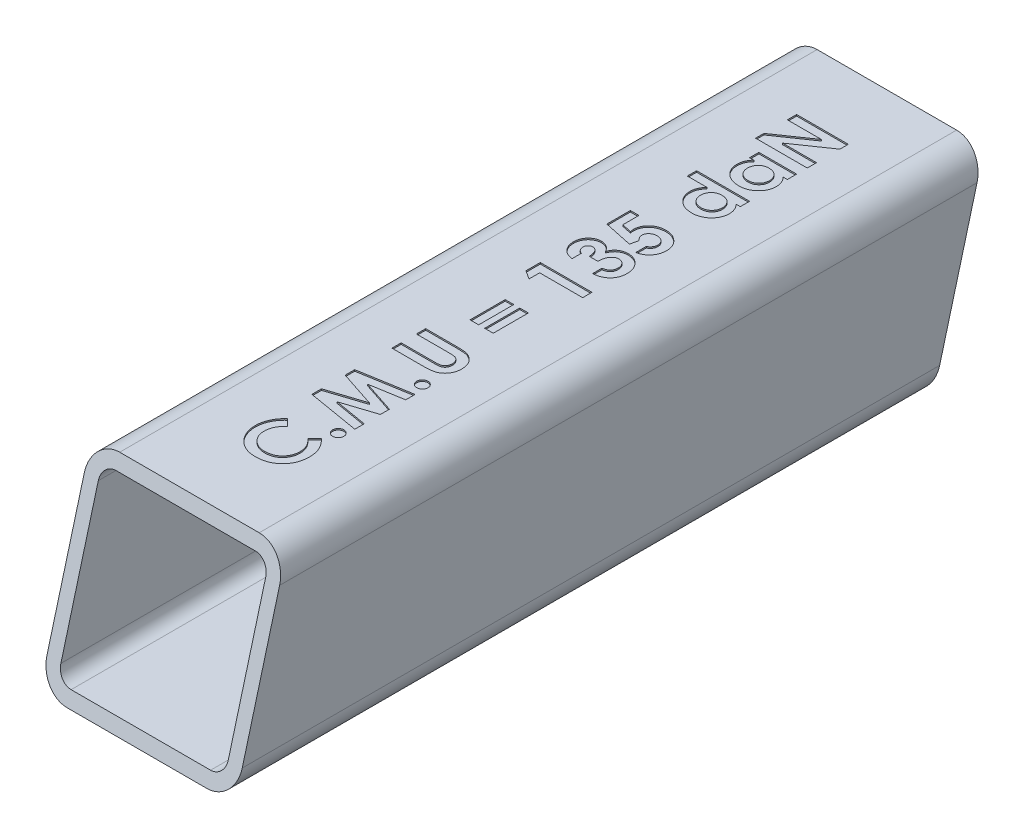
from build123d import *

# Parameters (mm, degrees)
BOSS_EXTRU_1_DEPTH      = 270
ENL_V_MAT_EXTRU_2_DEPTH = 125
ESQUISSE6_W             = 3.086805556
ESQUISSE6_H             = 12.584668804
ENL_V_MAT_EXTRU_4_DEPTH = 0.5


with BuildPart() as part:
    # Esquisse1 → Boss.-Extru.1 (new body)
    with BuildSketch(Plane.XY):
        with BuildLine():
            Line((-25, 35), (25, 35))
            ThreePointArc((25, 35), (32.071067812, 32.071067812), (35, 25))
            Line((35, 25), (35, -25))
            ThreePointArc((35, -25), (32.071067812, -32.071067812), (25, -35))
            Line((25, -35), (-25, -35))
            ThreePointArc((-25, -35), (-32.071067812, -32.071067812), (-35, -25))
            Line((-35, -25), (-35, 25))
            ThreePointArc((-35, 25), (-32.071067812, 32.071067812), (-25, 35))
        make_face()
        with BuildLine():
            Line((-25, 30), (25, 30))
            ThreePointArc((25, 30), (28.535533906, 28.535533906), (30, 25))
            Line((30, 25), (30, -25))
            ThreePointArc((30, -25), (28.535533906, -28.535533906), (25, -30))
            Line((25, -30), (-25, -30))
            ThreePointArc((-25, -30), (-28.535533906, -28.535533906), (-30, -25))
            Line((-30, -25), (-30, 25))
            ThreePointArc((-30, 25), (-28.535533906, 28.535533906), (-25, 30))
        make_face(mode=Mode.SUBTRACT)
    extrude(amount=BOSS_EXTRU_1_DEPTH)

    # Esquisse2 → Enl_v. mat.-Extru.2 (cut, symmetric)
    with BuildSketch(Plane(origin=(0, 0, 0), x_dir=(0, 0, -1), z_dir=(1, 0, 0))):
        Polygon((0, 35), (0, -35), (-18.75644347, -35), align=None)
        Polygon((-268.75644347, -35), (-250, 35), (-270, 35), (-270, -35), align=None)
    extrude(amount=ENL_V_MAT_EXTRU_2_DEPTH, both=True, mode=Mode.SUBTRACT)

    # Esquisse6 → Enl_v. mat.-Extru.4 (cut)
    # profile 1 of 13: a face of its own
    with BuildSketch(Plane(origin=(0, 35, 0), x_dir=(1, 0, 0), z_dir=(0, 1, 0))):
        with BuildLine():
            Line((-5.307884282, -209.507191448), (-2.977939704, -211.944729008))
            add(Edge.make_bspline(
                [(-2.977939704, -211.944729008), (-3.191779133, -212.151481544), (-3.609474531, -212.555334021), (-4.161854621, -213.206421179), (-4.624123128, -213.881798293), (-5.005632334, -214.574726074), (-5.305912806, -215.28656068), (-5.518244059, -216.019689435), (-5.64913729, -216.773041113), (-5.663999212, -217.283045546), (-5.671474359, -217.539564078)],
                knots=[0, 0, 0, 0, 1.115315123, 2.178559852, 3.196385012, 4.180486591, 5.141138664, 6.08807191, 7.038351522, 8, 8, 8, 8], degree=3))
            add(Edge.make_bspline(
                [(-5.671474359, -217.539564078), (-5.665551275, -217.753780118), (-5.65386272, -218.176511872), (-5.567967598, -218.797134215), (-5.42245016, -219.391016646), (-5.22018198, -219.958630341), (-4.965458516, -220.502781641), (-4.645289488, -221.018403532), (-4.270360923, -221.50826702), (-3.841328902, -221.966648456), (-3.369111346, -222.380467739), (-2.87178161, -222.753324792), (-2.340543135, -223.062159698), (-1.783143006, -223.314261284), (-1.199379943, -223.512923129), (-0.589283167, -223.653921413), (0.048524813, -223.735615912), (0.482117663, -223.747796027), (0.702482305, -223.75398632)],
                knots=[0, 0, 0, 0, 1.035268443, 2.04298821, 3.02163646, 3.985902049, 4.951223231, 5.920091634, 6.913651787, 7.92868536, 8.949353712, 9.945284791, 10.92850487, 11.913014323, 12.897904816, 13.904240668, 14.934873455, 16, 16, 16, 16], degree=3))
            add(Edge.make_bspline(
                [(0.702482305, -223.75398632), (0.857144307, -223.752174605), (1.16198629, -223.748603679), (1.611787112, -223.710580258), (2.049091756, -223.647258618), (2.472849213, -223.559051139), (2.883612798, -223.445976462), (3.282344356, -223.315355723), (3.664289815, -223.148519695), (4.036600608, -222.965002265), (4.390314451, -222.753871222), (4.725664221, -222.522682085), (5.042724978, -222.273565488), (5.340369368, -222.003194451), (5.614312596, -221.708164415), (5.872013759, -221.395600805), (6.109407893, -221.062398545), (6.322714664, -220.708424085), (6.521539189, -220.344389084), (6.686185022, -219.962793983), (6.83419367, -219.57431271), (6.945540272, -219.172127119), (7.042388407, -218.76332246), (7.10153655, -218.34220834), (7.146481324, -217.912781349), (7.14924849, -217.622548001), (7.150641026, -217.476492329)],
                knots=[0, 0, 0, 0, 1.103738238, 2.175490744, 3.219137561, 4.256155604, 5.262629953, 6.259184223, 7.247888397, 8.234817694, 9.220364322, 10.185094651, 11.140491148, 12.096499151, 13.05201798, 14.011605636, 14.986460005, 15.968997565, 16.960259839, 17.944382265, 18.933125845, 19.924977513, 20.920749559, 21.929466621, 22.958034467, 24, 24, 24, 24], degree=3))
            add(Edge.make_bspline(
                [(7.150641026, -217.476492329), (7.143502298, -217.228748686), (7.129476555, -216.741996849), (7.018996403, -216.027788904), (6.83919725, -215.346122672), (6.62073956, -214.803442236), (6.408913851, -214.37802307), (6.218492, -214.051441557), (5.998965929, -213.717313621), (5.749424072, -213.376148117), (5.470956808, -213.025964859), (5.158122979, -212.672558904), (4.821034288, -212.306996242), (4.580455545, -212.067515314), (4.45710637, -211.944729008)],
                knots=[0, 0, 0, 0, 1.404693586, 2.759857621, 4.088769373, 5.395275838, 6.0697462, 6.783214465, 7.53810233, 8.336454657, 9.18000028, 10.074808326, 11.012918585, 12, 12, 12, 12], degree=3))
            Line((4.45710637, -211.944729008), (6.939165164, -209.581393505))
            add(Edge.make_bspline(
                [(6.939165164, -209.581393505), (7.099558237, -209.74752327), (7.412611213, -210.071773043), (7.857117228, -210.560894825), (8.256555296, -211.049401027), (8.625423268, -211.525490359), (8.952975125, -211.996961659), (9.239537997, -212.463764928), (9.492359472, -212.92061575), (9.707175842, -213.377000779), (9.88957725, -213.835759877), (10.046612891, -214.307769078), (10.179459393, -214.794471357), (10.286649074, -215.298839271), (10.372600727, -215.816168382), (10.430617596, -216.351300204), (10.469620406, -216.900841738), (10.473125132, -217.273604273), (10.474893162, -217.461651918)],
                knots=[0, 0, 0, 0, 1.244526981, 2.429050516, 3.560637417, 4.644440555, 5.67424972, 6.652764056, 7.595344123, 8.486817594, 9.369275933, 10.254498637, 11.166417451, 12.086725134, 13.032340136, 13.991389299, 14.986715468, 16, 16, 16, 16], degree=3))
            add(Edge.make_bspline(
                [(10.474893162, -217.461651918), (10.466087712, -217.807072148), (10.448857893, -218.482963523), (10.321196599, -219.47346471), (10.107174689, -220.414414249), (9.804488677, -221.308101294), (9.417821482, -222.154241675), (8.943785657, -222.952618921), (8.383640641, -223.701946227), (7.743951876, -224.396170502), (7.037469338, -225.024129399), (6.278900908, -225.579172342), (5.464518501, -226.038303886), (4.606353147, -226.4195307), (3.700488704, -226.717645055), (2.745945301, -226.927467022), (1.743644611, -227.056862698), (1.059050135, -227.071018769), (0.709902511, -227.078238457)],
                knots=[0, 0, 0, 0, 1.078019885, 2.10938526, 3.111377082, 4.085535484, 5.04941344, 6.010039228, 6.978205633, 7.964457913, 8.951525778, 9.924444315, 10.892603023, 11.863865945, 12.85144698, 13.863884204, 14.910567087, 16, 16, 16, 16], degree=3))
            add(Edge.make_bspline(
                [(0.709902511, -227.078238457), (0.482185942, -227.075217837), (0.03090736, -227.069231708), (-0.634986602, -227.005137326), (-1.283300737, -226.918080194), (-1.908494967, -226.775071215), (-2.517685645, -226.608816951), (-3.105481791, -226.394622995), (-3.67435942, -226.145772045), (-4.223600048, -225.861630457), (-4.747272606, -225.536189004), (-5.248716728, -225.181869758), (-5.721436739, -224.790079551), (-6.167381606, -224.364783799), (-6.591602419, -223.909912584), (-6.983666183, -223.417675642), (-7.354091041, -222.896467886), (-7.691829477, -222.342678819), (-7.998996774, -221.768927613), (-8.263260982, -221.178002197), (-8.490009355, -220.577520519), (-8.676692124, -219.965661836), (-8.816418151, -219.341344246), (-8.922083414, -218.708751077), (-8.981173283, -218.062572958), (-8.99084452, -217.628717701), (-8.995726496, -217.409710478)],
                knots=[0, 0, 0, 0, 1.071814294, 2.12407397, 3.147667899, 4.14936388, 5.141177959, 6.119239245, 7.091825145, 8.063277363, 9.028022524, 9.992609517, 10.952139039, 11.915934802, 12.892469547, 13.878248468, 14.87668965, 15.901326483, 16.93027266, 17.938917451, 18.9468897, 19.950817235, 20.948103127, 21.957084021, 22.968749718, 24, 24, 24, 24], degree=3))
            add(Edge.make_bspline(
                [(-8.995726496, -217.409710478), (-8.992925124, -217.222875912), (-8.987351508, -216.851149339), (-8.940971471, -216.297570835), (-8.867925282, -215.748480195), (-8.758484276, -215.205554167), (-8.625946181, -214.66635124), (-8.462695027, -214.133128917), (-8.263566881, -213.607357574), (-8.043289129, -213.084479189), (-7.792514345, -212.574921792), (-7.511821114, -212.083113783), (-7.208552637, -211.607836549), (-6.877492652, -211.151955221), (-6.523503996, -210.712258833), (-6.14659839, -210.289216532), (-5.739938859, -209.886887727), (-5.452630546, -209.634396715), (-5.307884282, -209.507191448)],
                knots=[0, 0, 0, 0, 0.996333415, 1.982307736, 2.96084097, 3.949129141, 4.93457382, 5.921430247, 6.92116383, 7.931890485, 8.946633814, 9.948019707, 10.950686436, 11.952094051, 12.951305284, 13.960287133, 14.972390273, 16, 16, 16, 16], degree=3))
        make_face()
    # profile 2 of 13: a face of its own
    with BuildSketch(Plane(origin=(0, 35, 0), x_dir=(1, 0, 0), z_dir=(0, 1, 0))):
        with BuildLine():
            add(Edge.make_bspline(
                [(6.200854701, -204.876983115), (6.207725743, -204.742621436), (6.221271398, -204.477739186), (6.336417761, -204.098624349), (6.52393841, -203.751127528), (6.778777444, -203.444446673), (7.083071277, -203.183716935), (7.430790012, -202.995509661), (7.811030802, -202.878251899), (8.076075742, -202.865310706), (8.211730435, -202.858687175)],
                knots=[0, 0, 0, 0, 1.01719242, 2.005305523, 2.97459142, 3.994072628, 5.012345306, 5.994342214, 6.97346883, 8, 8, 8, 8], degree=3))
            add(Edge.make_bspline(
                [(8.211730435, -202.858687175), (8.347332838, -202.865474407), (8.613462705, -202.878794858), (8.995527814, -202.994509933), (9.344480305, -203.184803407), (9.652097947, -203.444104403), (9.910107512, -203.751070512), (10.10257272, -204.097613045), (10.216805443, -204.477853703), (10.230500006, -204.742659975), (10.237446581, -204.876983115)],
                knots=[0, 0, 0, 0, 1.023125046, 2.0079595, 2.986698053, 4.008755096, 5.030812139, 6.001348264, 6.986182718, 8, 8, 8, 8], degree=3))
            add(Edge.make_bspline(
                [(10.237446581, -204.876983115), (10.230556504, -205.011338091), (10.216973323, -205.276207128), (10.101609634, -205.657038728), (9.911392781, -206.006140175), (9.651782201, -206.313181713), (9.345582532, -206.573648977), (8.994403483, -206.758607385), (8.613609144, -206.875439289), (8.347382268, -206.888582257), (8.211730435, -206.895279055)],
                knots=[0, 0, 0, 0, 1.013339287, 1.99770941, 2.975986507, 3.997561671, 5.019136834, 5.992987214, 6.977357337, 8, 8, 8, 8], degree=3))
            add(Edge.make_bspline(
                [(8.211730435, -206.895279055), (8.076026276, -206.88874605), (7.810884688, -206.875981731), (7.431908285, -206.757619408), (7.081975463, -206.574724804), (6.779089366, -206.312844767), (6.522663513, -206.006063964), (6.337379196, -205.656040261), (6.221104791, -205.276319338), (6.207669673, -205.011375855), (6.200854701, -204.876983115)],
                knots=[0, 0, 0, 0, 1.026040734, 2.004699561, 2.981785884, 3.999572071, 5.018566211, 5.995652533, 6.983293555, 8, 8, 8, 8], degree=3))
        make_face()
    # profile 3 of 13: a face of its own
    with BuildSketch(Plane(origin=(0, 35, 0), x_dir=(1, 0, 0), z_dir=(0, 1, 0))):
        Polygon((-8.520833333, -197.594051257), (-8.520833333, -194.143655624), (4.397744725, -189.917848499), (-8.520833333, -185.662360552), (-8.520833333, -182.245355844), (10, -179.114029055), (10, -182.479092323), (-1.697954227, -184.456577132), (10, -188.307663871), (10, -191.550293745), (-1.697954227, -195.379119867), (10, -197.352894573), (10, -200.721667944), align=None)
    # profile 4 of 13: a face of its own
    with BuildSketch(Plane(origin=(0, 35, 0), x_dir=(1, 0, 0), z_dir=(0, 1, 0))):
        with BuildLine():
            add(Edge.make_bspline(
                [(6.200854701, -174.721267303), (6.207725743, -174.586905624), (6.221271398, -174.322023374), (6.336417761, -173.942908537), (6.52393841, -173.595411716), (6.778777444, -173.288730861), (7.083071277, -173.028001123), (7.430790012, -172.839793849), (7.811030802, -172.722536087), (8.076075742, -172.709594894), (8.211730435, -172.702971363)],
                knots=[0, 0, 0, 0, 1.01719242, 2.005305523, 2.97459142, 3.994072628, 5.012345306, 5.994342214, 6.97346883, 8, 8, 8, 8], degree=3))
            add(Edge.make_bspline(
                [(8.211730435, -172.702971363), (8.347332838, -172.709758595), (8.613462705, -172.723079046), (8.995527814, -172.838794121), (9.344480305, -173.029087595), (9.652097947, -173.288388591), (9.910107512, -173.5953547), (10.10257272, -173.941897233), (10.216805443, -174.322137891), (10.230500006, -174.586944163), (10.237446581, -174.721267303)],
                knots=[0, 0, 0, 0, 1.023125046, 2.0079595, 2.986698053, 4.008755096, 5.030812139, 6.001348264, 6.986182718, 8, 8, 8, 8], degree=3))
            add(Edge.make_bspline(
                [(10.237446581, -174.721267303), (10.230556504, -174.855622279), (10.216973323, -175.120491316), (10.101609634, -175.501322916), (9.911392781, -175.850424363), (9.651782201, -176.157465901), (9.345582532, -176.417933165), (8.994403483, -176.602891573), (8.613609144, -176.719723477), (8.347382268, -176.732866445), (8.211730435, -176.739563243)],
                knots=[0, 0, 0, 0, 1.013339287, 1.99770941, 2.975986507, 3.997561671, 5.019136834, 5.992987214, 6.977357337, 8, 8, 8, 8], degree=3))
            add(Edge.make_bspline(
                [(8.211730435, -176.739563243), (8.076026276, -176.733030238), (7.810884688, -176.720265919), (7.431908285, -176.601903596), (7.081975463, -176.419008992), (6.779089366, -176.157128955), (6.522663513, -175.850348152), (6.337379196, -175.500324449), (6.221104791, -175.120603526), (6.207669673, -174.855660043), (6.200854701, -174.721267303)],
                knots=[0, 0, 0, 0, 1.026040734, 2.004699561, 2.981785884, 3.999572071, 5.018566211, 5.995652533, 6.983293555, 8, 8, 8, 8], degree=3))
        make_face()
    # profile 5 of 13: a face of its own
    with BuildSketch(Plane(origin=(0, 35, 0), x_dir=(1, 0, 0), z_dir=(0, 1, 0))):
        with BuildLine():
            Line((-8.520833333, -168.903826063), (-8.520833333, -165.579573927))
            Line((-8.520833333, -165.579573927), (3.529580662, -165.579573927))
            add(Edge.make_bspline(
                [(3.529580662, -165.579573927), (3.654513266, -165.57938582), (3.895819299, -165.579022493), (4.242028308, -165.561642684), (4.561446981, -165.545262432), (4.851486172, -165.517391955), (5.113046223, -165.473675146), (5.347090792, -165.432859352), (5.551534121, -165.376900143), (5.7844034, -165.293100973), (6.04600707, -165.162271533), (6.321748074, -164.954764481), (6.567180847, -164.706965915), (6.773257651, -164.415145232), (6.947559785, -164.089337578), (7.062846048, -163.723122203), (7.141042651, -163.328404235), (7.14738173, -163.053403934), (7.150641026, -162.912009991)],
                knots=[0, 0, 0, 0, 1.155195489, 2.231248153, 3.20507519, 4.113220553, 4.92363642, 5.657123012, 6.309133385, 6.880755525, 7.944644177, 8.999147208, 10.058600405, 11.156792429, 12.29246015, 13.460660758, 14.694375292, 16, 16, 16, 16], degree=3))
            add(Edge.make_bspline(
                [(7.150641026, -162.912009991), (7.146262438, -162.761959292), (7.137724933, -162.469385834), (7.053920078, -162.048565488), (6.920474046, -161.658673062), (6.730012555, -161.307963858), (6.501711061, -160.996787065), (6.241375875, -160.733381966), (5.948487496, -160.52550525), (5.678276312, -160.390013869), (5.429568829, -160.313954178), (5.207363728, -160.256898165), (4.946370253, -160.21546835), (4.648401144, -160.176681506), (4.311285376, -160.154691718), (3.936785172, -160.129648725), (3.524672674, -160.120668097), (3.23771697, -160.119113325), (3.088078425, -160.118302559)],
                knots=[0, 0, 0, 0, 1.26131785, 2.459356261, 3.594833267, 4.716926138, 5.803419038, 6.833631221, 7.818372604, 8.814377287, 9.360705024, 10.004324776, 10.743421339, 11.582437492, 12.532246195, 13.585177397, 14.740744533, 16, 16, 16, 16], degree=3))
            Line((3.088078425, -160.118302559), (-8.520833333, -160.118302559))
            Line((-8.520833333, -160.118302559), (-8.520833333, -156.794050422))
            Line((-8.520833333, -156.794050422), (2.527852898, -156.794050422))
            add(Edge.make_bspline(
                [(2.527852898, -156.794050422), (2.751698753, -156.794512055), (3.182132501, -156.79539973), (3.800696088, -156.809031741), (4.365654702, -156.838051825), (4.877173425, -156.862425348), (5.334563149, -156.909596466), (5.739777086, -156.958737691), (6.091379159, -157.021372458), (6.491635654, -157.11456904), (6.95251469, -157.275399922), (7.483204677, -157.534674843), (8.002752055, -157.863828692), (8.505591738, -158.252789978), (8.972263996, -158.692271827), (9.383107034, -159.170619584), (9.724956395, -159.685638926), (10.001357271, -160.234950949), (10.214184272, -160.82435224), (10.364615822, -161.455232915), (10.460339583, -162.131200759), (10.469944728, -162.597550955), (10.474893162, -162.837807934)],
                knots=[0, 0, 0, 0, 1.170930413, 2.251584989, 3.235934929, 4.130173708, 4.929654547, 5.640582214, 6.264911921, 6.796838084, 7.789064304, 8.810388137, 9.880124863, 11.000704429, 12.131026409, 13.227749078, 14.29171941, 15.356377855, 16.43689688, 17.561893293, 18.743922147, 20, 20, 20, 20], degree=3))
            add(Edge.make_bspline(
                [(10.474893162, -162.837807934), (10.472196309, -162.997457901), (10.466875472, -163.312444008), (10.420204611, -163.775726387), (10.350863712, -164.223426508), (10.251664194, -164.655781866), (10.116249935, -165.071301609), (9.956223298, -165.472675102), (9.773122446, -165.861356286), (9.550908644, -166.225198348), (9.317498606, -166.573139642), (9.062111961, -166.893507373), (8.796073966, -167.191227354), (8.513295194, -167.462841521), (8.215790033, -167.708603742), (7.903267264, -167.928323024), (7.575654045, -168.12158914), (7.227072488, -168.293290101), (6.839795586, -168.440234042), (6.400061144, -168.564175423), (5.902121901, -168.671920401), (5.342697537, -168.753483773), (4.724335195, -168.825371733), (4.044675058, -168.871952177), (3.305916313, -168.895995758), (2.793760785, -168.901150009), (2.527852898, -168.903826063)],
                knots=[0, 0, 0, 0, 1.001237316, 1.975420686, 2.917953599, 3.841913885, 4.754568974, 5.656377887, 6.55158913, 7.445656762, 8.327865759, 9.178398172, 10.013362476, 10.830881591, 11.635451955, 12.431789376, 13.224756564, 14.019278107, 14.866442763, 15.819105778, 16.882716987, 18.059987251, 19.363897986, 20.787153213, 22.331910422, 24, 24, 24, 24], degree=3))
            Line((2.527852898, -168.903826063), (-8.520833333, -168.903826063))
        make_face()
    # profile 6 of 13: a face of its own
    with BuildSketch(Plane(origin=(0, 35, 0), x_dir=(1, 0, 0), z_dir=(0, 1, 0))):
        with Locations((-1.753605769, -139.816619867)):
            Rectangle(ESQUISSE6_W, ESQUISSE6_H)
    # profile 7 of 13: a face of its own
    with BuildSketch(Plane(origin=(0, 35, 0), x_dir=(1, 0, 0), z_dir=(0, 1, 0))):
        with Locations((3.470219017, -139.816619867)):
            Rectangle(ESQUISSE6_W, ESQUISSE6_H)
    # profile 8 of 13: a face of its own
    with BuildSketch(Plane(origin=(0, 35, 0), x_dir=(1, 0, 0), z_dir=(0, 1, 0))):
        Polygon((-8.520833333, -120.854284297), (-8.520833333, -115.715791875), (10, -115.715791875), (10, -119.040044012), (-5.434027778, -119.040044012), (-5.434027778, -122.839189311), align=None)
    # profile 9 of 13: a face of its own
    with BuildSketch(Plane(origin=(0, 35, 0), x_dir=(1, 0, 0), z_dir=(0, 1, 0))):
        with BuildLine():
            Line((-4.009348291, -105.505588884), (-4.009348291, -108.829841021))
            add(Edge.make_bspline(
                [(-4.009348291, -108.829841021), (-4.175552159, -108.806516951), (-4.500189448, -108.76095927), (-4.971307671, -108.648965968), (-5.41930635, -108.519452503), (-5.841781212, -108.3538231), (-6.238276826, -108.162633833), (-6.609148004, -107.939681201), (-6.959717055, -107.695310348), (-7.16980224, -107.503983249), (-7.274238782, -107.408871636)],
                knots=[0, 0, 0, 0, 1.1115466, 2.171125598, 3.205689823, 4.19946166, 5.17440286, 6.118867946, 7.064860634, 8, 8, 8, 8], degree=3))
            add(Edge.make_bspline(
                [(-7.274238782, -107.408871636), (-7.412248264, -107.272024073), (-7.684250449, -107.002311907), (-8.032655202, -106.551591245), (-8.334175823, -106.079152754), (-8.573223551, -105.575521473), (-8.766704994, -105.048534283), (-8.896666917, -104.4940004), (-8.9828978, -103.914185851), (-8.991391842, -103.518535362), (-8.995726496, -103.316628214)],
                knots=[0, 0, 0, 0, 1.01925491, 2.00884431, 2.983262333, 3.955970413, 4.92937149, 5.924503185, 6.940838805, 8, 8, 8, 8], degree=3))
            add(Edge.make_bspline(
                [(-8.995726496, -103.316628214), (-8.991488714, -103.137122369), (-8.983158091, -102.784250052), (-8.916284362, -102.265616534), (-8.798995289, -101.771142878), (-8.645642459, -101.295602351), (-8.436980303, -100.845988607), (-8.194767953, -100.412378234), (-7.897684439, -100.00688632), (-7.562009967, -99.628564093), (-7.198945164, -99.281002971), (-6.810858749, -98.980013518), (-6.408117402, -98.721247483), (-5.987375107, -98.508058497), (-5.547919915, -98.344145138), (-5.0922905, -98.230384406), (-4.621492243, -98.155925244), (-4.301497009, -98.148507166), (-4.13920189, -98.144744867)],
                knots=[0, 0, 0, 0, 1.091422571, 2.145516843, 3.172569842, 4.178562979, 5.178154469, 6.181868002, 7.194278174, 8.227918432, 9.254613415, 10.245994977, 11.209837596, 12.161663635, 13.10878368, 14.055455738, 15.013766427, 16, 16, 16, 16], degree=3))
            add(Edge.make_bspline(
                [(-4.13920189, -98.144744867), (-3.93824858, -98.152613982), (-3.541421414, -98.168153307), (-2.961778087, -98.291046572), (-2.408794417, -98.488604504), (-1.889022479, -98.769502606), (-1.403003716, -99.12224925), (-0.967712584, -99.554826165), (-0.576407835, -100.05516184), (-0.366117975, -100.430760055), (-0.258434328, -100.623093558)],
                knots=[0, 0, 0, 0, 0.992776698, 1.96045919, 2.915875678, 3.886951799, 4.871409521, 5.874469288, 6.911574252, 8, 8, 8, 8], degree=3))
            add(Edge.make_bspline(
                [(-0.258434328, -100.623093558), (-0.215096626, -100.491073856), (-0.129939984, -100.231661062), (0.037878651, -99.863011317), (0.220886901, -99.512179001), (0.434529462, -99.187187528), (0.663998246, -98.879124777), (0.92163111, -98.597737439), (1.200815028, -98.335739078), (1.504519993, -98.099611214), (1.827696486, -97.888501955), (2.16453589, -97.702453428), (2.516269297, -97.546323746), (2.880311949, -97.415284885), (3.260246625, -97.315305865), (3.654785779, -97.244966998), (4.062978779, -97.204296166), (4.339531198, -97.198094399), (4.479366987, -97.194958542)],
                knots=[0, 0, 0, 0, 1.059375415, 2.081625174, 3.086260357, 4.075579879, 5.045586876, 6.014170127, 6.982201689, 7.963705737, 8.945119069, 9.924852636, 10.896327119, 11.878239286, 12.873838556, 13.889973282, 14.933087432, 16, 16, 16, 16], degree=3))
            add(Edge.make_bspline(
                [(4.479366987, -97.194958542), (4.684868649, -97.201315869), (5.090076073, -97.213851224), (5.686904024, -97.293547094), (6.255930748, -97.441920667), (6.803683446, -97.637133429), (7.323166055, -97.897454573), (7.826013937, -98.204071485), (8.295174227, -98.579380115), (8.739650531, -99.000253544), (9.145719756, -99.465217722), (9.504486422, -99.965549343), (9.800232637, -100.502217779), (10.053018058, -101.062248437), (10.240624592, -101.658257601), (10.378011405, -102.282535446), (10.461601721, -102.939640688), (10.47039988, -103.388110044), (10.474893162, -103.617146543)],
                knots=[0, 0, 0, 0, 1.005228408, 1.982105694, 2.937129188, 3.876607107, 4.82066901, 5.774063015, 6.75178259, 7.752926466, 8.764612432, 9.766578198, 10.757677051, 11.756882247, 12.76686714, 13.807379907, 14.880213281, 16, 16, 16, 16], degree=3))
            add(Edge.make_bspline(
                [(10.474893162, -103.617146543), (10.470166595, -103.833815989), (10.460924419, -104.257484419), (10.3809287, -104.877188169), (10.251889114, -105.466157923), (10.069997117, -106.025896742), (9.834114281, -106.554239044), (9.553230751, -107.055976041), (9.211145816, -107.52109568), (8.823301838, -107.954780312), (8.388162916, -108.347409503), (7.915808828, -108.698327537), (7.404443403, -108.99979661), (6.85625141, -109.253053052), (6.270271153, -109.45611697), (5.647694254, -109.616293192), (4.98730439, -109.728178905), (4.532942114, -109.762253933), (4.301282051, -109.779627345)],
                knots=[0, 0, 0, 0, 1.066544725, 2.085487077, 3.070979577, 4.031932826, 4.977951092, 5.916076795, 6.857635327, 7.814973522, 8.776389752, 9.738577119, 10.707772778, 11.69409279, 12.707140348, 13.757286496, 14.856535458, 16, 16, 16, 16], degree=3))
            Line((4.301282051, -109.779627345), (4.301282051, -106.455375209))
            add(Edge.make_bspline(
                [(4.301282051, -106.455375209), (4.417761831, -106.434305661), (4.644636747, -106.393267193), (4.973133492, -106.313296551), (5.276236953, -106.208809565), (5.55617396, -106.089349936), (5.815817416, -105.957273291), (6.048223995, -105.7994646), (6.262527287, -105.63025867), (6.508854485, -105.375903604), (6.767180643, -105.021020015), (6.995966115, -104.540528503), (7.126085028, -104.003588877), (7.142273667, -103.628976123), (7.150641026, -103.435351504)],
                knots=[0, 0, 0, 0, 0.928450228, 1.808400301, 2.64896863, 3.43999153, 4.194978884, 4.9294959, 5.640047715, 6.332896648, 7.70085756, 9.063442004, 10.482192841, 12, 12, 12, 12], degree=3))
            add(Edge.make_bspline(
                [(7.150641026, -103.435351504), (7.14886907, -103.332593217), (7.145398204, -103.131312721), (7.107277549, -102.835586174), (7.043763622, -102.554153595), (6.959789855, -102.284677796), (6.845837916, -102.031393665), (6.71359707, -101.788566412), (6.551714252, -101.560636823), (6.367264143, -101.348932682), (6.17030539, -101.151906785), (5.954780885, -100.983669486), (5.731039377, -100.83842182), (5.493162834, -100.723811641), (5.248660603, -100.627890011), (4.989761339, -100.568065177), (4.722084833, -100.52316565), (4.538930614, -100.520542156), (4.445976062, -100.519210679)],
                knots=[0, 0, 0, 0, 1.110702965, 2.175618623, 3.217100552, 4.227908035, 5.221854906, 6.215531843, 7.213608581, 8.237687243, 9.249555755, 10.220750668, 11.188994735, 12.127982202, 13.071814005, 14.022160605, 14.996205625, 16, 16, 16, 16], degree=3))
            add(Edge.make_bspline(
                [(4.445976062, -100.519210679), (4.344281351, -100.522596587), (4.143046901, -100.529296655), (3.84814745, -100.58825693), (3.563379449, -100.676511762), (3.291092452, -100.803438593), (3.032887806, -100.969528), (2.786627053, -101.171475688), (2.55427083, -101.411108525), (2.329051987, -101.680401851), (2.131896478, -101.990221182), (1.950345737, -102.328055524), (1.8057866, -102.702227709), (1.676700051, -103.103761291), (1.582409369, -103.540206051), (1.513947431, -104.008864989), (1.46298745, -104.508978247), (1.455676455, -104.853712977), (1.451923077, -105.030695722)],
                knots=[0, 0, 0, 0, 0.809868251, 1.602574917, 2.388262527, 3.182133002, 3.988875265, 4.829537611, 5.714850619, 6.646378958, 7.622533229, 8.636771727, 9.698525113, 10.814716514, 11.996253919, 13.252421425, 14.589425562, 16, 16, 16, 16], degree=3))
            Line((1.451923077, -105.030695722), (-1.634882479, -105.030695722))
            add(Edge.make_bspline(
                [(-1.634882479, -105.030695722), (-1.653578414, -104.810314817), (-1.688554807, -104.398025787), (-1.771499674, -103.82614008), (-1.878798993, -103.343046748), (-2.018639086, -102.943223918), (-2.181982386, -102.605739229), (-2.371243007, -102.315053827), (-2.588573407, -102.061439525), (-2.833656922, -101.852831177), (-3.090554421, -101.678986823), (-3.363778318, -101.559981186), (-3.642457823, -101.480215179), (-3.833208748, -101.472713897), (-3.927726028, -101.468997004)],
                knots=[0, 0, 0, 0, 1.700711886, 3.181695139, 4.441392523, 5.500267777, 6.431839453, 7.31822765, 8.161090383, 8.990537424, 9.787217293, 10.536619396, 11.274893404, 12, 12, 12, 12], degree=3))
            add(Edge.make_bspline(
                [(-3.927726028, -101.468997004), (-4.048332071, -101.475383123), (-4.283729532, -101.487847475), (-4.621233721, -101.586550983), (-4.923684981, -101.754054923), (-5.187700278, -101.981331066), (-5.403061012, -102.260542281), (-5.563233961, -102.583678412), (-5.65667296, -102.94910207), (-5.666428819, -103.206017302), (-5.671474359, -103.338888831)],
                knots=[0, 0, 0, 0, 1.009324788, 1.969988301, 2.915956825, 3.885795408, 4.868116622, 5.850437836, 6.888288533, 8, 8, 8, 8], degree=3))
            add(Edge.make_bspline(
                [(-5.671474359, -103.338888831), (-5.665545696, -103.459336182), (-5.653781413, -103.698340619), (-5.56597592, -104.047836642), (-5.4181663, -104.379741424), (-5.214345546, -104.687182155), (-4.969565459, -104.965720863), (-4.679674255, -105.19432078), (-4.362039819, -105.384459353), (-4.127373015, -105.465054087), (-4.009348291, -105.505588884)],
                knots=[0, 0, 0, 0, 0.98818071, 1.960853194, 2.938124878, 3.957524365, 4.978590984, 5.968022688, 6.978025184, 8, 8, 8, 8], degree=3))
        make_face()
    # profile 10 of 13: a face of its own
    with BuildSketch(Plane(origin=(0, 35, 0), x_dir=(1, 0, 0), z_dir=(0, 1, 0))):
        with BuildLine():
            Line((-8.520833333, -91.856120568), (-8.520833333, -83.423056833))
            Line((-8.520833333, -83.423056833), (-5.434027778, -83.423056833))
            Line((-5.434027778, -83.423056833), (-5.434027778, -89.221947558))
            Line((-5.434027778, -89.221947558), (-1.931690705, -89.94541761))
            add(Edge.make_bspline(
                [(-1.931690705, -89.94541761), (-1.959147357, -89.846834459), (-2.013297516, -89.652408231), (-2.067603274, -89.359504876), (-2.102802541, -89.075640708), (-2.107497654, -88.889370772), (-2.109775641, -88.798995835)],
                knots=[0, 0, 0, 0, 1.05461699, 2.079921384, 3.068411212, 4, 4, 4, 4], degree=3))
            add(Edge.make_bspline(
                [(-2.109775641, -88.798995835), (-2.105262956, -88.602059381), (-2.096367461, -88.213854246), (-2.011920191, -87.645959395), (-1.878918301, -87.102166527), (-1.689230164, -86.584139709), (-1.442346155, -86.092384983), (-1.143685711, -85.626306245), (-0.792724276, -85.185331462), (-0.389242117, -84.777294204), (0.053790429, -84.402372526), (0.532977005, -84.07639951), (1.041484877, -83.797998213), (1.582474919, -83.576567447), (2.152549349, -83.401795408), (2.75207349, -83.27550123), (3.381757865, -83.200817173), (3.811346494, -83.190746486), (4.030444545, -83.185610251)],
                knots=[0, 0, 0, 0, 1.01440847, 1.999622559, 2.951875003, 3.895578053, 4.836219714, 5.782137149, 6.743708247, 7.735272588, 8.734977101, 9.730283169, 10.717124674, 11.717316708, 12.737475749, 13.78628267, 14.87096371, 16, 16, 16, 16], degree=3))
            add(Edge.make_bspline(
                [(4.030444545, -83.185610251), (4.252027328, -83.191891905), (4.689274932, -83.204287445), (5.332227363, -83.285018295), (5.947862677, -83.427905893), (6.537548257, -83.622480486), (7.096206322, -83.883974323), (7.634190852, -84.189591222), (8.139946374, -84.56149701), (8.614980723, -84.981710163), (9.049456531, -85.440394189), (9.430673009, -85.929986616), (9.75713558, -86.442270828), (10.016060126, -86.984494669), (10.221947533, -87.548365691), (10.371506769, -88.135841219), (10.457343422, -88.749455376), (10.468978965, -89.166031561), (10.474893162, -89.377771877)],
                knots=[0, 0, 0, 0, 1.068214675, 2.107899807, 3.117335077, 4.110871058, 5.095206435, 6.086091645, 7.088956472, 8.115291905, 9.140102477, 10.129911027, 11.102477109, 12.062389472, 13.02046727, 13.992137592, 14.979429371, 16, 16, 16, 16], degree=3))
            add(Edge.make_bspline(
                [(10.474893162, -89.377771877), (10.469895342, -89.5670873), (10.460038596, -89.940456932), (10.403618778, -90.491290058), (10.291569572, -91.019581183), (10.15089504, -91.530538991), (9.956983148, -92.017099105), (9.734146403, -92.489287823), (9.454379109, -92.932890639), (9.146174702, -93.360510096), (8.796149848, -93.755707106), (8.417914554, -94.12263603), (8.004398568, -94.447339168), (7.563639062, -94.741913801), (7.087406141, -94.990354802), (6.584266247, -95.212446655), (6.04855592, -95.393882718), (5.677222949, -95.48601281), (5.488514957, -95.532832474)],
                knots=[0, 0, 0, 0, 1.055144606, 2.080965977, 3.079696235, 4.061281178, 5.030010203, 5.994686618, 6.966205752, 7.947572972, 8.929036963, 9.903776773, 10.879904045, 11.854643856, 12.853445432, 13.868704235, 14.916895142, 16, 16, 16, 16], degree=3))
            Line((5.488514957, -95.532832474), (5.488514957, -91.733687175))
            add(Edge.make_bspline(
                [(5.488514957, -91.733687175), (5.619316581, -91.664260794), (5.873514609, -91.529338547), (6.21048231, -91.272300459), (6.499250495, -90.986521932), (6.734477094, -90.667340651), (6.920875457, -90.325353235), (7.056359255, -89.962286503), (7.135848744, -89.580333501), (7.145677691, -89.320011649), (7.150641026, -89.188556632)],
                knots=[0, 0, 0, 0, 1.10506944, 2.147576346, 3.153981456, 4.13180336, 5.099527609, 6.055753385, 7.01821161, 8, 8, 8, 8], degree=3))
            add(Edge.make_bspline(
                [(7.150641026, -89.188556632), (7.147194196, -89.096945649), (7.140412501, -88.916699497), (7.104535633, -88.651135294), (7.036585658, -88.397642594), (6.942490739, -88.154336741), (6.825143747, -87.920564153), (6.677000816, -87.699676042), (6.506482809, -87.487829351), (6.310812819, -87.288249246), (6.092686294, -87.107487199), (5.858294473, -86.948978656), (5.612845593, -86.807250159), (5.346616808, -86.702269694), (5.067557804, -86.616299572), (4.773563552, -86.552987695), (4.464290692, -86.515151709), (4.253158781, -86.511649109), (4.145457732, -86.509862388)],
                knots=[0, 0, 0, 0, 0.978869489, 1.925942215, 2.855067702, 3.774946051, 4.70828698, 5.642468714, 6.60995405, 7.609372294, 8.622401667, 9.629904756, 10.629323, 11.642352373, 12.678539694, 13.745912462, 14.850161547, 16, 16, 16, 16], degree=3))
            add(Edge.make_bspline(
                [(4.145457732, -86.509862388), (4.040256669, -86.511936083), (3.835480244, -86.515972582), (3.534795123, -86.549363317), (3.249499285, -86.609098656), (2.977407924, -86.690488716), (2.720172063, -86.794677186), (2.476265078, -86.92200435), (2.246902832, -87.073005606), (2.036818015, -87.248523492), (1.843943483, -87.435601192), (1.675890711, -87.636915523), (1.534493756, -87.848668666), (1.418967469, -88.070468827), (1.323249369, -88.300283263), (1.26376049, -88.543296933), (1.218353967, -88.793597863), (1.215782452, -88.964492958), (1.214476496, -89.051282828)],
                knots=[0, 0, 0, 0, 1.166353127, 2.270334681, 3.348811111, 4.394351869, 5.415506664, 6.421447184, 7.440758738, 8.453871, 9.452682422, 10.416618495, 11.356052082, 12.270018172, 13.186757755, 14.10810127, 15.039190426, 16, 16, 16, 16], degree=3))
            add(Edge.make_bspline(
                [(1.214476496, -89.051282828), (1.217955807, -89.14557373), (1.224929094, -89.334552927), (1.284650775, -89.614354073), (1.373045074, -89.893248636), (1.505032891, -90.167608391), (1.674380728, -90.440013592), (1.878982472, -90.710933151), (2.122108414, -90.979271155), (2.303934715, -91.14882022), (2.397999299, -91.236533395)],
                knots=[0, 0, 0, 0, 0.882519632, 1.768758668, 2.670168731, 3.618680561, 4.612333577, 5.671392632, 6.795336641, 8, 8, 8, 8], degree=3))
            Line((2.397999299, -91.236533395), (1.756151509, -94.03395093))
            Line((1.756151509, -94.03395093), (-8.520833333, -91.856120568))
        make_face()
    # profile 11 of 13: a face of its own
    with BuildSketch(Plane(origin=(0, 35, 0), x_dir=(1, 0, 0), z_dir=(0, 1, 0))):
        with BuildLine():
            Line((-8.995726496, -62.527757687), (-8.995726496, -59.203505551))
            Line((-8.995726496, -59.203505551), (10, -59.203505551))
            Line((10, -59.203505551), (10, -62.527757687))
            Line((10, -62.527757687), (8.523379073, -62.527757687))
            add(Edge.make_bspline(
                [(8.523379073, -62.527757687), (8.666701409, -62.692755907), (8.945336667, -63.013531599), (9.312891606, -63.513515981), (9.605718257, -64.022307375), (9.844665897, -64.529958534), (10.019884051, -65.050988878), (10.147109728, -65.58720954), (10.222052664, -66.146703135), (10.232261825, -66.527025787), (10.237446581, -66.720173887)],
                knots=[0, 0, 0, 0, 1.129123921, 2.195147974, 3.200207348, 4.157999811, 5.089597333, 6.035096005, 7.002117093, 8, 8, 8, 8], degree=3))
            add(Edge.make_bspline(
                [(10.237446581, -66.720173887), (10.232570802, -66.936993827), (10.222935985, -67.365442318), (10.12144487, -67.994119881), (9.966238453, -68.60126018), (9.746060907, -69.185943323), (9.462447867, -69.749308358), (9.114330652, -70.288191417), (8.708003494, -70.808241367), (8.23929126, -71.294708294), (7.729967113, -71.74602123), (7.180644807, -72.137197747), (6.602317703, -72.470644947), (5.992305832, -72.74067884), (5.352777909, -72.954288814), (4.681926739, -73.106346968), (3.979720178, -73.196113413), (3.501396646, -73.207219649), (3.258743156, -73.212853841)],
                knots=[0, 0, 0, 0, 0.980565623, 1.937653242, 2.874408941, 3.813202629, 4.759425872, 5.723639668, 6.712366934, 7.741707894, 8.776921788, 9.78808311, 10.788528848, 11.79333378, 12.802261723, 13.835597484, 14.901998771, 16, 16, 16, 16], degree=3))
            add(Edge.make_bspline(
                [(3.258743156, -73.212853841), (3.007473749, -73.206944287), (2.51458081, -73.195352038), (1.791319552, -73.110419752), (1.103763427, -72.961352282), (0.450499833, -72.756543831), (-0.168670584, -72.497640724), (-0.751255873, -72.175654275), (-1.299347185, -71.795114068), (-1.806892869, -71.360486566), (-2.265464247, -70.883487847), (-2.666892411, -70.377277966), (-3.014402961, -69.849114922), (-3.287168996, -69.288615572), (-3.504194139, -68.707227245), (-3.661353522, -68.100925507), (-3.756041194, -67.468913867), (-3.766570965, -67.038331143), (-3.771901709, -66.820346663)],
                knots=[0, 0, 0, 0, 1.136200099, 2.228783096, 3.287341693, 4.313263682, 5.320819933, 6.317074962, 7.317731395, 8.33320375, 9.333922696, 10.3051871, 11.251461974, 12.186899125, 13.117710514, 14.053682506, 15.014667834, 16, 16, 16, 16], degree=3))
            add(Edge.make_bspline(
                [(-3.771901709, -66.820346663), (-3.766035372, -66.618467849), (-3.754429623, -66.219078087), (-3.666957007, -65.631044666), (-3.524614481, -65.06224195), (-3.329317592, -64.511239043), (-3.069711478, -63.981911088), (-2.757040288, -63.472468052), (-2.38823921, -62.981359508), (-2.103001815, -62.68086978), (-1.957661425, -62.527757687)],
                knots=[0, 0, 0, 0, 1.011981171, 2.002067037, 2.973628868, 3.94845042, 4.927444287, 5.923956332, 6.942168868, 8, 8, 8, 8], degree=3))
            Line((-1.957661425, -62.527757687), (-8.995726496, -62.527757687))
        make_face()
        with BuildLine():
            add(Edge.make_bspline(
                [(-0.685096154, -66.122847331), (-0.681030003, -66.255307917), (-0.673060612, -66.514922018), (-0.625170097, -66.896738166), (-0.54064887, -67.261570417), (-0.416256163, -67.607141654), (-0.263364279, -67.936830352), (-0.07810577, -68.250706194), (0.147698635, -68.544263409), (0.401631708, -68.820431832), (0.681095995, -69.073905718), (0.988472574, -69.287038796), (1.308986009, -69.476275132), (1.651022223, -69.628919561), (2.014170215, -69.741921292), (2.394397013, -69.830097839), (2.795098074, -69.876074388), (3.068194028, -69.88438415), (3.206801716, -69.888601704)],
                knots=[0, 0, 0, 0, 1.048146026, 2.054297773, 3.039291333, 4.004895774, 4.954855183, 5.911393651, 6.882091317, 7.879305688, 8.877191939, 9.859995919, 10.833402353, 11.818978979, 12.815424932, 13.838562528, 14.902979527, 16, 16, 16, 16], degree=3))
            add(Edge.make_bspline(
                [(3.206801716, -69.888601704), (3.346665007, -69.884444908), (3.622263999, -69.876253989), (4.02636861, -69.829397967), (4.41206425, -69.74421191), (4.775932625, -69.619511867), (5.122992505, -69.469098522), (5.449604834, -69.280354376), (5.757210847, -69.058438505), (6.041745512, -68.802106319), (6.299665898, -68.522206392), (6.526938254, -68.224152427), (6.723158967, -67.911488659), (6.876667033, -67.579885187), (7.002876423, -67.235763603), (7.086154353, -66.872986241), (7.139474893, -66.495439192), (7.14689328, -66.23804278), (7.150641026, -66.108006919)],
                knots=[0, 0, 0, 0, 1.099325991, 2.166209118, 3.191924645, 4.196940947, 5.184751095, 6.160002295, 7.155385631, 8.160260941, 9.164478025, 10.142244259, 11.102414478, 12.058888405, 13.008821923, 13.977708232, 14.978344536, 16, 16, 16, 16], degree=3))
            add(Edge.make_bspline(
                [(7.150641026, -66.108006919), (7.146555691, -65.973076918), (7.138546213, -65.708540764), (7.09104207, -65.320526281), (7.006397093, -64.950680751), (6.880615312, -64.600876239), (6.73077326, -64.26396536), (6.539057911, -63.948189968), (6.315779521, -63.649484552), (6.058896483, -63.373402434), (5.780940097, -63.116255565), (5.472092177, -62.897588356), (5.146203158, -62.705646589), (4.795009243, -62.554945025), (4.425005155, -62.435197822), (4.033798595, -62.349299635), (3.620994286, -62.302571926), (3.339238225, -62.294449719), (3.195671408, -62.290311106)],
                knots=[0, 0, 0, 0, 1.050155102, 2.058874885, 3.037059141, 3.995876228, 4.947712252, 5.901735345, 6.864168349, 7.84500044, 8.832936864, 9.80518476, 10.78407896, 11.771077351, 12.772424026, 13.806938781, 14.882541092, 16, 16, 16, 16], degree=3))
            add(Edge.make_bspline(
                [(3.195671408, -62.290311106), (3.054572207, -62.294394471), (2.778964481, -62.302370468), (2.374802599, -62.349543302), (1.991193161, -62.435857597), (1.626877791, -62.554185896), (1.281981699, -62.705674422), (0.963122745, -62.898712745), (0.658362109, -63.11616599), (0.384713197, -63.373801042), (0.129469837, -63.648690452), (-0.083515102, -63.952715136), (-0.27179019, -64.268656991), (-0.425486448, -64.603956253), (-0.538445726, -64.959821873), (-0.625822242, -65.330258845), (-0.673038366, -65.720952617), (-0.681011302, -65.986696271), (-0.685096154, -66.122847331)],
                knots=[0, 0, 0, 0, 1.106392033, 2.161105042, 3.184375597, 4.183944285, 5.160535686, 6.12997743, 7.101598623, 8.089721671, 9.071306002, 10.0372504, 10.99341283, 11.95232427, 12.921232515, 13.916134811, 14.932352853, 16, 16, 16, 16], degree=3))
        make_face(mode=Mode.SUBTRACT)
    # profile 12 of 13: a face of its own
    with BuildSketch(Plane(origin=(0, 35, 0), x_dir=(1, 0, 0), z_dir=(0, 1, 0))):
        with BuildLine():
            Line((-3.534455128, -45.669050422), (-3.534455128, -42.344798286))
            Line((-3.534455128, -42.344798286), (10, -42.344798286))
            Line((10, -42.344798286), (10, -45.669050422))
            Line((10, -45.669050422), (8.523379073, -45.669050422))
            add(Edge.make_bspline(
                [(8.523379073, -45.669050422), (8.666701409, -45.834048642), (8.945336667, -46.154824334), (9.312891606, -46.654808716), (9.605718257, -47.16360011), (9.844665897, -47.671251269), (10.019884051, -48.192281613), (10.147109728, -48.728502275), (10.222052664, -49.28799587), (10.232261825, -49.668318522), (10.237446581, -49.861466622)],
                knots=[0, 0, 0, 0, 1.129123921, 2.195147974, 3.200207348, 4.157999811, 5.089597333, 6.035096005, 7.002117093, 8, 8, 8, 8], degree=3))
            add(Edge.make_bspline(
                [(10.237446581, -49.861466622), (10.232570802, -50.078286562), (10.222935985, -50.506735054), (10.12144487, -51.135412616), (9.966238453, -51.742552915), (9.746060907, -52.327236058), (9.462447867, -52.890601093), (9.114330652, -53.429484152), (8.708003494, -53.949534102), (8.23929126, -54.436001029), (7.729967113, -54.887313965), (7.180644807, -55.278490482), (6.602317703, -55.611937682), (5.992305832, -55.881971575), (5.352777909, -56.095581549), (4.681926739, -56.247639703), (3.979720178, -56.337406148), (3.501396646, -56.348512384), (3.258743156, -56.354146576)],
                knots=[0, 0, 0, 0, 0.980565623, 1.937653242, 2.874408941, 3.813202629, 4.759425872, 5.723639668, 6.712366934, 7.741707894, 8.776921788, 9.78808311, 10.788528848, 11.79333378, 12.802261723, 13.835597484, 14.901998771, 16, 16, 16, 16], degree=3))
            add(Edge.make_bspline(
                [(3.258743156, -56.354146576), (3.007473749, -56.348237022), (2.51458081, -56.336644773), (1.791319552, -56.251712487), (1.103763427, -56.102645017), (0.450499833, -55.897836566), (-0.168670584, -55.638933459), (-0.751255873, -55.31694701), (-1.299347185, -54.936406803), (-1.806892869, -54.501779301), (-2.265464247, -54.024780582), (-2.666892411, -53.518570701), (-3.014402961, -52.990407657), (-3.287168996, -52.429908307), (-3.504194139, -51.84851998), (-3.661353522, -51.242218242), (-3.756041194, -50.610206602), (-3.766570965, -50.179623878), (-3.771901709, -49.961639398)],
                knots=[0, 0, 0, 0, 1.136200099, 2.228783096, 3.287341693, 4.313263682, 5.320819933, 6.317074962, 7.317731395, 8.33320375, 9.333922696, 10.3051871, 11.251461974, 12.186899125, 13.117710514, 14.053682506, 15.014667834, 16, 16, 16, 16], degree=3))
            add(Edge.make_bspline(
                [(-3.771901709, -49.961639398), (-3.767812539, -49.759695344), (-3.759721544, -49.360120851), (-3.668107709, -48.773504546), (-3.53758729, -48.202952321), (-3.343044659, -47.653736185), (-3.092741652, -47.123199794), (-2.786517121, -46.615130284), (-2.429708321, -46.122722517), (-2.15136818, -45.822142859), (-2.009602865, -45.669050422)],
                knots=[0, 0, 0, 0, 1.016860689, 2.012000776, 2.985574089, 3.963288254, 4.94189597, 5.937036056, 6.949282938, 8, 8, 8, 8], degree=3))
            Line((-2.009602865, -45.669050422), (-3.534455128, -45.669050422))
        make_face()
        with BuildLine():
            add(Edge.make_bspline(
                [(-0.685096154, -49.264140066), (-0.681030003, -49.396600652), (-0.673060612, -49.656214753), (-0.625170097, -50.038030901), (-0.54064887, -50.402863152), (-0.416256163, -50.748434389), (-0.263364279, -51.078123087), (-0.07810577, -51.391998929), (0.147698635, -51.685556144), (0.401631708, -51.961724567), (0.681095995, -52.215198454), (0.988472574, -52.428331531), (1.308986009, -52.617567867), (1.651022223, -52.770212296), (2.014170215, -52.883214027), (2.394397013, -52.971390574), (2.795098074, -53.017367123), (3.068194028, -53.025676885), (3.206801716, -53.029894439)],
                knots=[0, 0, 0, 0, 1.048146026, 2.054297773, 3.039291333, 4.004895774, 4.954855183, 5.911393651, 6.882091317, 7.879305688, 8.877191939, 9.859995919, 10.833402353, 11.818978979, 12.815424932, 13.838562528, 14.902979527, 16, 16, 16, 16], degree=3))
            add(Edge.make_bspline(
                [(3.206801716, -53.029894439), (3.346665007, -53.025737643), (3.622263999, -53.017546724), (4.02636861, -52.970690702), (4.41206425, -52.885504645), (4.775932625, -52.760804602), (5.122992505, -52.610391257), (5.449604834, -52.421647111), (5.757210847, -52.19973124), (6.041745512, -51.943399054), (6.299665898, -51.663499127), (6.526938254, -51.365445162), (6.723158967, -51.052781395), (6.876667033, -50.721177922), (7.002876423, -50.377056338), (7.086154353, -50.014278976), (7.139474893, -49.636731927), (7.14689328, -49.379335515), (7.150641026, -49.249299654)],
                knots=[0, 0, 0, 0, 1.099325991, 2.166209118, 3.191924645, 4.196940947, 5.184751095, 6.160002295, 7.155385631, 8.160260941, 9.164478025, 10.142244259, 11.102414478, 12.058888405, 13.008821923, 13.977708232, 14.978344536, 16, 16, 16, 16], degree=3))
            add(Edge.make_bspline(
                [(7.150641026, -49.249299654), (7.146555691, -49.114369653), (7.138546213, -48.849833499), (7.09104207, -48.461819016), (7.006397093, -48.091973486), (6.880615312, -47.742168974), (6.73077326, -47.405258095), (6.539057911, -47.089482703), (6.315779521, -46.790777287), (6.058896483, -46.514695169), (5.780940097, -46.2575483), (5.472092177, -46.038881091), (5.146203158, -45.846939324), (4.795009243, -45.69623776), (4.425005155, -45.576490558), (4.033798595, -45.49059237), (3.620994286, -45.443864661), (3.339238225, -45.435742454), (3.195671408, -45.431603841)],
                knots=[0, 0, 0, 0, 1.050155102, 2.058874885, 3.037059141, 3.995876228, 4.947712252, 5.901735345, 6.864168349, 7.84500044, 8.832936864, 9.80518476, 10.78407896, 11.771077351, 12.772424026, 13.806938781, 14.882541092, 16, 16, 16, 16], degree=3))
            add(Edge.make_bspline(
                [(3.195671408, -45.431603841), (3.054572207, -45.435687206), (2.778964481, -45.443663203), (2.374802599, -45.490836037), (1.991193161, -45.577150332), (1.626877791, -45.695478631), (1.281981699, -45.846967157), (0.963122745, -46.04000548), (0.658362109, -46.257458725), (0.384713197, -46.515093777), (0.129469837, -46.789983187), (-0.083515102, -47.094007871), (-0.27179019, -47.409949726), (-0.425486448, -47.745248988), (-0.538445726, -48.101114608), (-0.625822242, -48.47155158), (-0.673038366, -48.862245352), (-0.681011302, -49.127989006), (-0.685096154, -49.264140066)],
                knots=[0, 0, 0, 0, 1.106392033, 2.161105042, 3.184375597, 4.183944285, 5.160535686, 6.12997743, 7.101598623, 8.089721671, 9.071306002, 10.0372504, 10.99341283, 11.95232427, 12.921232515, 13.916134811, 14.932352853, 16, 16, 16, 16], degree=3))
        make_face(mode=Mode.SUBTRACT)
    # profile 13 of 13: a face of its own
    with BuildSketch(Plane(origin=(0, 35, 0), x_dir=(1, 0, 0), z_dir=(0, 1, 0))):
        Polygon((-8.520833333, -38.545652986), (-8.520833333, -35.551600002), (3.666854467, -27.148217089), (-8.520833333, -27.148217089), (-8.520833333, -23.823964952), (10, -23.823964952), (10, -26.840278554), (-2.150586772, -35.22140085), (10, -35.22140085), (10, -38.545652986), align=None)
    extrude(amount=-ENL_V_MAT_EXTRU_4_DEPTH, mode=Mode.SUBTRACT)


solid = part.part
